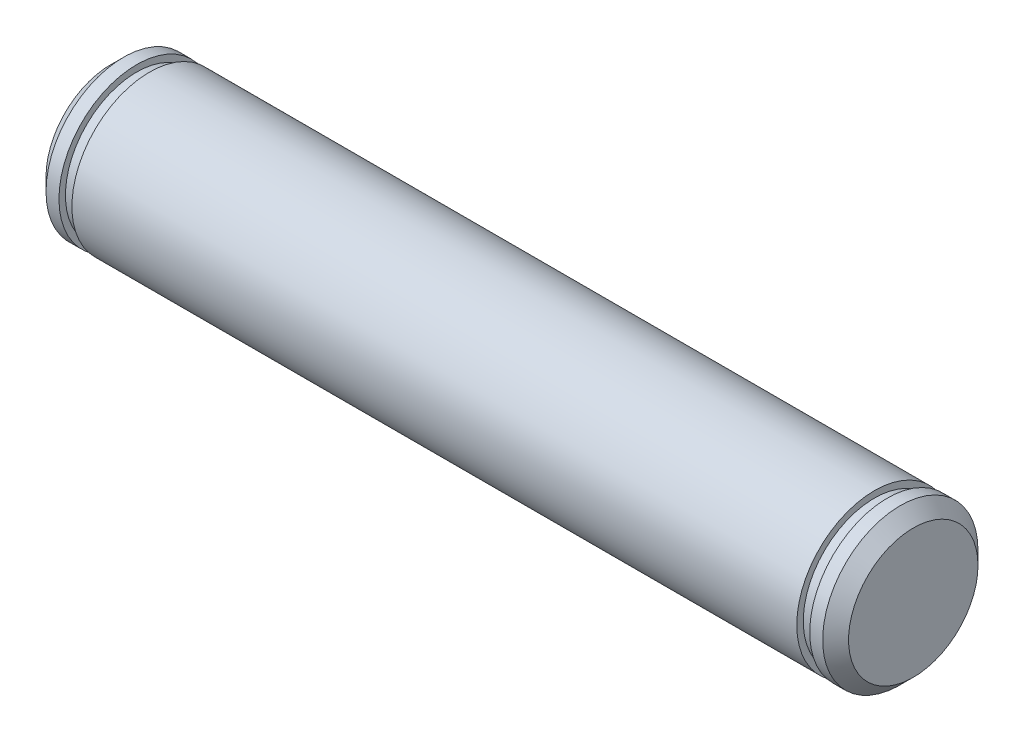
ISO-10303-21;
HEADER;
FILE_DESCRIPTION(('STEP AP214'),'2;1');
FILE_NAME('part.step','',(''),(''),'','','');
FILE_SCHEMA(('AUTOMOTIVE_DESIGN { 1 0 10303 214 1 1 1 1 }'));
ENDSEC;
DATA;
#1=APPLICATION_CONTEXT('core data for automotive mechanical design processes');
#2=APPLICATION_PROTOCOL_DEFINITION('international standard','automotive_design',2000,#1);
#3=PRODUCT_CONTEXT('',#1,'mechanical');
#4=PRODUCT('Part','Part','',(#3));
#5=PRODUCT_RELATED_PRODUCT_CATEGORY('part','',(#4));
#6=PRODUCT_DEFINITION_FORMATION('','',#4);
#7=PRODUCT_DEFINITION_CONTEXT('part definition',#1,'design');
#8=PRODUCT_DEFINITION('design','',#6,#7);
#9=PRODUCT_DEFINITION_SHAPE('','',#8);
#10=(LENGTH_UNIT() NAMED_UNIT(*) SI_UNIT(.MILLI.,.METRE.));
#11=(NAMED_UNIT(*) PLANE_ANGLE_UNIT() SI_UNIT($,.RADIAN.));
#12=(NAMED_UNIT(*) SI_UNIT($,.STERADIAN.) SOLID_ANGLE_UNIT());
#13=UNCERTAINTY_MEASURE_WITH_UNIT(LENGTH_MEASURE(1.E-05),#10,'distance_accuracy_value','');
#14=(GEOMETRIC_REPRESENTATION_CONTEXT(3) GLOBAL_UNCERTAINTY_ASSIGNED_CONTEXT((#13)) GLOBAL_UNIT_ASSIGNED_CONTEXT((#10,
#11,#12)) REPRESENTATION_CONTEXT('',''));
#15=CARTESIAN_POINT('',(0.,0.,0.));
#16=DIRECTION('',(0.,0.,1.));
#17=DIRECTION('',(1.,0.,0.));
#18=AXIS2_PLACEMENT_3D('',#15,#16,#17);
#19=CARTESIAN_POINT('',(40.,0.,0.));
#20=DIRECTION('',(1.,0.,0.));
#21=DIRECTION('',(0.,0.,-1.));
#22=AXIS2_PLACEMENT_3D('',#19,#20,#21);
#23=CYLINDRICAL_SURFACE('',#22,6.);
#24=CARTESIAN_POINT('',(-2.00000000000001,0.,0.));
#25=DIRECTION('',(1.,0.,0.));
#26=DIRECTION('',(0.,0.,-1.));
#27=AXIS2_PLACEMENT_3D('',#24,#25,#26);
#28=CIRCLE('',#27,6.);
#29=CARTESIAN_POINT('',(-2.00000000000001,0.,-6.));
#30=VERTEX_POINT('',#29);
#31=EDGE_CURVE('E42',#30,#30,#28,.F.);
#32=ORIENTED_EDGE('',*,*,#31,.F.);
#33=EDGE_LOOP('',(#32));
#34=FACE_BOUND('',#33,.T.);
#35=CARTESIAN_POINT('',(-1.00000000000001,0.,0.));
#36=DIRECTION('',(1.,0.,0.));
#37=DIRECTION('',(0.,0.,-1.));
#38=AXIS2_PLACEMENT_3D('',#35,#36,#37);
#39=CIRCLE('',#38,6.);
#40=CARTESIAN_POINT('',(-1.00000000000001,0.,-6.));
#41=VERTEX_POINT('',#40);
#42=EDGE_CURVE('E30',#41,#41,#39,.F.);
#43=ORIENTED_EDGE('',*,*,#42,.T.);
#44=EDGE_LOOP('',(#43));
#45=FACE_BOUND('',#44,.T.);
#46=ADVANCED_FACE('F22',(#34,#45),#23,.T.);
#47=CARTESIAN_POINT('',(0.,0.,0.));
#48=DIRECTION('',(1.,0.,0.));
#49=DIRECTION('',(0.,0.,-1.));
#50=AXIS2_PLACEMENT_3D('',#47,#48,#49);
#51=PLANE('',#50);
#52=CARTESIAN_POINT('',(0.,0.,0.));
#53=DIRECTION('',(1.,0.,0.));
#54=DIRECTION('',(0.,0.,-1.));
#55=AXIS2_PLACEMENT_3D('',#52,#53,#54);
#56=CIRCLE('',#55,4.99999999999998);
#57=CARTESIAN_POINT('',(0.,0.,-4.99999999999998));
#58=VERTEX_POINT('',#57);
#59=EDGE_CURVE('E45',#58,#58,#56,.T.);
#60=ORIENTED_EDGE('',*,*,#59,.T.);
#61=EDGE_LOOP('',(#60));
#62=FACE_BOUND('',#61,.T.);
#63=ADVANCED_FACE('F24',(#62),#51,.T.);
#64=CARTESIAN_POINT('',(0.,0.,0.));
#65=DIRECTION('',(-1.,0.,0.));
#66=DIRECTION('',(0.,0.,1.));
#67=AXIS2_PLACEMENT_3D('',#64,#65,#66);
#68=CONICAL_SURFACE('',#67,4.99999999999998,0.785398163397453);
#69=ORIENTED_EDGE('',*,*,#42,.F.);
#70=EDGE_LOOP('',(#69));
#71=FACE_BOUND('',#70,.T.);
#72=ORIENTED_EDGE('',*,*,#59,.F.);
#73=EDGE_LOOP('',(#72));
#74=FACE_BOUND('',#73,.T.);
#75=ADVANCED_FACE('F91',(#71,#74),#68,.T.);
#76=CARTESIAN_POINT('',(-2.00000000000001,10.,0.));
#77=DIRECTION('',(1.,0.,0.));
#78=DIRECTION('',(0.,0.,-1.));
#79=AXIS2_PLACEMENT_3D('',#76,#77,#78);
#80=PLANE('',#79);
#81=ORIENTED_EDGE('',*,*,#31,.T.);
#82=EDGE_LOOP('',(#81));
#83=FACE_BOUND('',#82,.T.);
#84=CARTESIAN_POINT('',(-2.00000000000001,0.,0.));
#85=DIRECTION('',(1.,0.,0.));
#86=DIRECTION('',(0.,0.,-1.));
#87=AXIS2_PLACEMENT_3D('',#84,#85,#86);
#88=CIRCLE('',#87,5.5);
#89=CARTESIAN_POINT('',(-2.00000000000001,0.,-5.5));
#90=VERTEX_POINT('',#89);
#91=EDGE_CURVE('E43',#90,#90,#88,.T.);
#92=ORIENTED_EDGE('',*,*,#91,.T.);
#93=EDGE_LOOP('',(#92));
#94=FACE_BOUND('',#93,.T.);
#95=ADVANCED_FACE('F115',(#83,#94),#80,.F.);
#96=CARTESIAN_POINT('',(0.,0.,0.));
#97=DIRECTION('',(1.,0.,0.));
#98=DIRECTION('',(0.,0.,-1.));
#99=AXIS2_PLACEMENT_3D('',#96,#97,#98);
#100=CYLINDRICAL_SURFACE('',#99,5.5);
#101=ORIENTED_EDGE('',*,*,#91,.F.);
#102=EDGE_LOOP('',(#101));
#103=FACE_BOUND('',#102,.T.);
#104=CARTESIAN_POINT('',(-3.00000000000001,0.,0.));
#105=DIRECTION('',(1.,0.,0.));
#106=DIRECTION('',(0.,0.,-1.));
#107=AXIS2_PLACEMENT_3D('',#104,#105,#106);
#108=CIRCLE('',#107,5.5);
#109=CARTESIAN_POINT('',(-3.00000000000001,0.,-5.5));
#110=VERTEX_POINT('',#109);
#111=EDGE_CURVE('E52',#110,#110,#108,.T.);
#112=ORIENTED_EDGE('',*,*,#111,.T.);
#113=EDGE_LOOP('',(#112));
#114=FACE_BOUND('',#113,.T.);
#115=ADVANCED_FACE('F106',(#103,#114),#100,.T.);
#116=CARTESIAN_POINT('',(-3.00000000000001,10.,0.));
#117=DIRECTION('',(-1.,0.,0.));
#118=DIRECTION('',(0.,0.,1.));
#119=AXIS2_PLACEMENT_3D('',#116,#117,#118);
#120=PLANE('',#119);
#121=CARTESIAN_POINT('',(-3.00000000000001,0.,0.));
#122=DIRECTION('',(-1.,0.,0.));
#123=DIRECTION('',(0.,0.,1.));
#124=AXIS2_PLACEMENT_3D('',#121,#122,#123);
#125=CIRCLE('',#124,6.);
#126=CARTESIAN_POINT('',(-3.00000000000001,0.,6.));
#127=VERTEX_POINT('',#126);
#128=EDGE_CURVE('E39',#127,#127,#125,.F.);
#129=ORIENTED_EDGE('',*,*,#128,.T.);
#130=EDGE_LOOP('',(#129));
#131=FACE_BOUND('',#130,.T.);
#132=ORIENTED_EDGE('',*,*,#111,.F.);
#133=EDGE_LOOP('',(#132));
#134=FACE_BOUND('',#133,.T.);
#135=ADVANCED_FACE('F97',(#131,#134),#120,.F.);
#136=CARTESIAN_POINT('',(-59.,0.,0.));
#137=DIRECTION('',(1.,0.,0.));
#138=DIRECTION('',(0.,0.,-1.));
#139=AXIS2_PLACEMENT_3D('',#136,#137,#138);
#140=CIRCLE('',#139,6.);
#141=CARTESIAN_POINT('',(-59.,0.,-6.));
#142=VERTEX_POINT('',#141);
#143=EDGE_CURVE('E46',#142,#142,#140,.F.);
#144=ORIENTED_EDGE('',*,*,#143,.F.);
#145=EDGE_LOOP('',(#144));
#146=FACE_BOUND('',#145,.T.);
#147=ORIENTED_EDGE('',*,*,#128,.F.);
#148=EDGE_LOOP('',(#147));
#149=FACE_BOUND('',#148,.T.);
#150=ADVANCED_FACE('F81',(#146,#149),#23,.T.);
#151=CARTESIAN_POINT('',(-60.,10.,0.));
#152=DIRECTION('',(-1.,0.,0.));
#153=DIRECTION('',(0.,0.,1.));
#154=AXIS2_PLACEMENT_3D('',#151,#152,#153);
#155=PLANE('',#154);
#156=CARTESIAN_POINT('',(-60.,0.,0.));
#157=DIRECTION('',(-1.,0.,0.));
#158=DIRECTION('',(0.,0.,1.));
#159=AXIS2_PLACEMENT_3D('',#156,#157,#158);
#160=CIRCLE('',#159,6.);
#161=CARTESIAN_POINT('',(-60.,0.,6.));
#162=VERTEX_POINT('',#161);
#163=EDGE_CURVE('E26',#162,#162,#160,.F.);
#164=ORIENTED_EDGE('',*,*,#163,.T.);
#165=EDGE_LOOP('',(#164));
#166=FACE_BOUND('',#165,.T.);
#167=CARTESIAN_POINT('',(-60.,0.,0.));
#168=DIRECTION('',(1.,0.,0.));
#169=DIRECTION('',(0.,0.,-1.));
#170=AXIS2_PLACEMENT_3D('',#167,#168,#169);
#171=CIRCLE('',#170,5.5);
#172=CARTESIAN_POINT('',(-60.,0.,-5.5));
#173=VERTEX_POINT('',#172);
#174=EDGE_CURVE('E48',#173,#173,#171,.T.);
#175=ORIENTED_EDGE('',*,*,#174,.F.);
#176=EDGE_LOOP('',(#175));
#177=FACE_BOUND('',#176,.T.);
#178=ADVANCED_FACE('F96',(#166,#177),#155,.F.);
#179=CARTESIAN_POINT('',(0.,0.,0.));
#180=DIRECTION('',(1.,0.,0.));
#181=DIRECTION('',(0.,0.,-1.));
#182=AXIS2_PLACEMENT_3D('',#179,#180,#181);
#183=CYLINDRICAL_SURFACE('',#182,5.5);
#184=CARTESIAN_POINT('',(-59.,0.,0.));
#185=DIRECTION('',(1.,0.,0.));
#186=DIRECTION('',(0.,0.,-1.));
#187=AXIS2_PLACEMENT_3D('',#184,#185,#186);
#188=CIRCLE('',#187,5.5);
#189=CARTESIAN_POINT('',(-59.,0.,-5.5));
#190=VERTEX_POINT('',#189);
#191=EDGE_CURVE('E54',#190,#190,#188,.T.);
#192=ORIENTED_EDGE('',*,*,#191,.F.);
#193=EDGE_LOOP('',(#192));
#194=FACE_BOUND('',#193,.T.);
#195=ORIENTED_EDGE('',*,*,#174,.T.);
#196=EDGE_LOOP('',(#195));
#197=FACE_BOUND('',#196,.T.);
#198=ADVANCED_FACE('F103',(#194,#197),#183,.T.);
#199=CARTESIAN_POINT('',(-59.,10.,0.));
#200=DIRECTION('',(1.,0.,0.));
#201=DIRECTION('',(0.,0.,-1.));
#202=AXIS2_PLACEMENT_3D('',#199,#200,#201);
#203=PLANE('',#202);
#204=ORIENTED_EDGE('',*,*,#143,.T.);
#205=EDGE_LOOP('',(#204));
#206=FACE_BOUND('',#205,.T.);
#207=ORIENTED_EDGE('',*,*,#191,.T.);
#208=EDGE_LOOP('',(#207));
#209=FACE_BOUND('',#208,.T.);
#210=ADVANCED_FACE('F82',(#206,#209),#203,.F.);
#211=CARTESIAN_POINT('',(-62.,0.,0.));
#212=DIRECTION('',(-1.,0.,0.));
#213=DIRECTION('',(0.,0.,1.));
#214=AXIS2_PLACEMENT_3D('',#211,#212,#213);
#215=PLANE('',#214);
#216=CARTESIAN_POINT('',(-62.,0.,0.));
#217=DIRECTION('',(-1.,0.,0.));
#218=DIRECTION('',(0.,0.,1.));
#219=AXIS2_PLACEMENT_3D('',#216,#217,#218);
#220=CIRCLE('',#219,5.);
#221=CARTESIAN_POINT('',(-62.,0.,5.));
#222=VERTEX_POINT('',#221);
#223=EDGE_CURVE('E10',#222,#222,#220,.T.);
#224=ORIENTED_EDGE('',*,*,#223,.T.);
#225=EDGE_LOOP('',(#224));
#226=FACE_BOUND('',#225,.T.);
#227=ADVANCED_FACE('F73',(#226),#215,.T.);
#228=CARTESIAN_POINT('',(-61.,0.,0.));
#229=DIRECTION('',(1.,0.,0.));
#230=DIRECTION('',(0.,0.,-1.));
#231=AXIS2_PLACEMENT_3D('',#228,#229,#230);
#232=CONICAL_SURFACE('',#231,6.,0.785398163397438);
#233=ORIENTED_EDGE('',*,*,#223,.F.);
#234=EDGE_LOOP('',(#233));
#235=FACE_BOUND('',#234,.T.);
#236=CARTESIAN_POINT('',(-61.,0.,0.));
#237=DIRECTION('',(-1.,0.,0.));
#238=DIRECTION('',(0.,0.,1.));
#239=AXIS2_PLACEMENT_3D('',#236,#237,#238);
#240=CIRCLE('',#239,6.);
#241=CARTESIAN_POINT('',(-61.,0.,6.));
#242=VERTEX_POINT('',#241);
#243=EDGE_CURVE('E35',#242,#242,#240,.F.);
#244=ORIENTED_EDGE('',*,*,#243,.F.);
#245=EDGE_LOOP('',(#244));
#246=FACE_BOUND('',#245,.T.);
#247=ADVANCED_FACE('F71',(#235,#246),#232,.T.);
#248=ORIENTED_EDGE('',*,*,#163,.F.);
#249=EDGE_LOOP('',(#248));
#250=FACE_BOUND('',#249,.T.);
#251=ORIENTED_EDGE('',*,*,#243,.T.);
#252=EDGE_LOOP('',(#251));
#253=FACE_BOUND('',#252,.T.);
#254=ADVANCED_FACE('F69',(#250,#253),#23,.T.);
#255=CLOSED_SHELL('',(#46,#63,#75,#95,#115,#135,#150,#178,#198,#210,#227,#247,#254));
#256=MANIFOLD_SOLID_BREP('B2',#255);
#257=ADVANCED_BREP_SHAPE_REPRESENTATION('',(#18,#256),#14);
#258=SHAPE_DEFINITION_REPRESENTATION(#9,#257);
ENDSEC;
END-ISO-10303-21;
